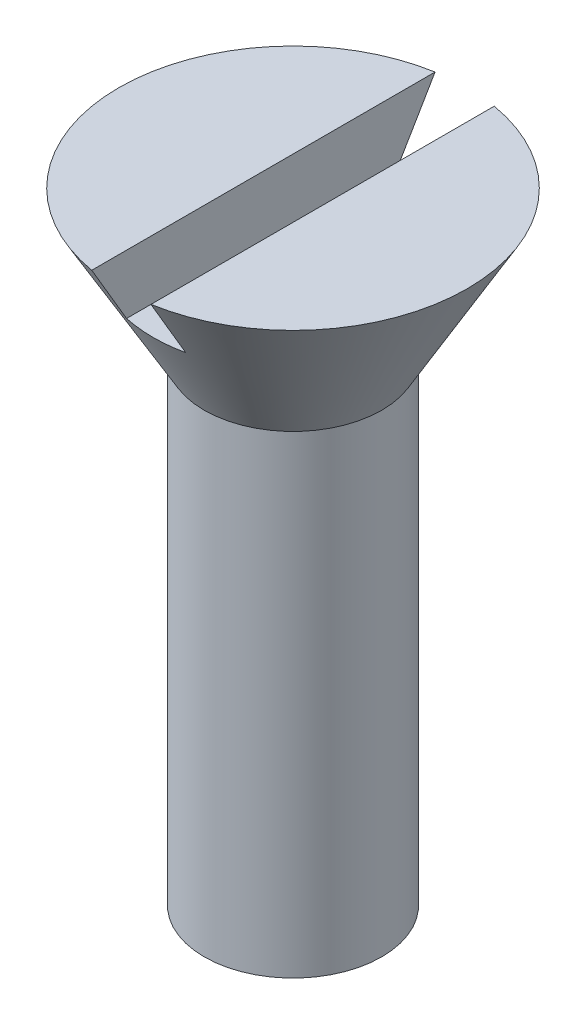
from build123d import *

# Parameters (mm, degrees)
SKETCH2_R           = 3
BOSS_EXTRUDE1_DEPTH = 16
SKETCH3_R           = 3
BOSS_EXTRUDE2_DEPTH = 5
BOSS_EXTRUDE2_DRAFT = -30
SKETCH5_W           = 2
SKETCH5_H           = 13.513566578
CUT_EXTRUDE1_DEPTH  = 2


with BuildPart() as part:
    # Sketch2 → Boss-Extrude1 (new body)
    with BuildSketch(Plane(origin=(0, 0, 0), x_dir=(1, 0, 0), z_dir=(0, 1, 0))):
        with Locations(Location((0, 0, 0), (0, 0, 270))):
            Circle(SKETCH2_R)
    extrude(amount=BOSS_EXTRUDE1_DEPTH)


with BuildPart() as boss_extrude2_tool:
    # Sketch3 → Boss-Extrude2 (with draft: the straight prism first)
    with BuildSketch(Plane(origin=(0, 16, 0), x_dir=(1, 0, 0), z_dir=(0, 1, 0))):
        with Locations(Location((0, 0, 0), (0, 0, 270))):
            Circle(SKETCH3_R)
    extrude(amount=BOSS_EXTRUDE2_DEPTH)
    # Boss-Extrude2: the draft: its side faces are tilted about the plane it starts from
    boss_extrude2_sides = [boss_extrude2_tool.faces().sort_by_distance(p)[0] for p in [
        (0, 18.5, -3),
    ]]
    draft(boss_extrude2_sides, Plane(origin=(0, 16, 0), x_dir=(1, 0, 0), z_dir=(0, 1, 0)), BOSS_EXTRUDE2_DRAFT)


with BuildPart() as part_1:
    add(part.part)

    # Boss-Extrude2: add boss_extrude2_tool
    add(boss_extrude2_tool.part)

    # Boss-Extrude3 cone 1 section (on through the dimple's axis) → Boss-Extrude3 (revolve)
    with BuildSketch(Plane(origin=(0, 0, 0), x_dir=(0, 0, 1), z_dir=(1, 0, 0))):
        Polygon((0, 0), (3, 0), (0, 1.732050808), align=None)
    revolve(axis=Axis((0, 0, 0), (0, -1, 0)))

    # Sketch5 → Cut-Extrude1 (cut)
    with BuildSketch(Plane(origin=(0, 21, 0), x_dir=(1, 0, 0), z_dir=(0, 1, 0))):
        Rectangle(SKETCH5_W, SKETCH5_H)
    extrude(amount=-CUT_EXTRUDE1_DEPTH, mode=Mode.SUBTRACT)


solid = part_1.part
